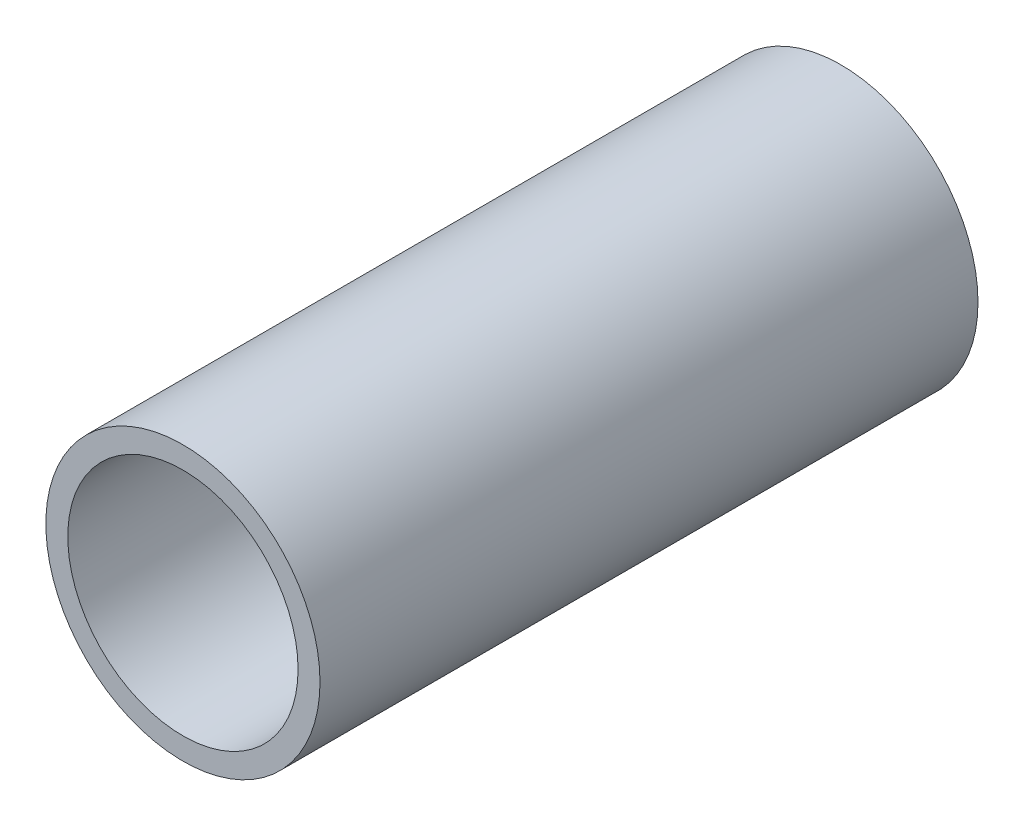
ISO-10303-21;
HEADER;
FILE_DESCRIPTION(('STEP AP214'),'2;1');
FILE_NAME('part.step','',(''),(''),'','','');
FILE_SCHEMA(('AUTOMOTIVE_DESIGN { 1 0 10303 214 1 1 1 1 }'));
ENDSEC;
DATA;
#1=APPLICATION_CONTEXT('core data for automotive mechanical design processes');
#2=APPLICATION_PROTOCOL_DEFINITION('international standard','automotive_design',2000,#1);
#3=PRODUCT_CONTEXT('',#1,'mechanical');
#4=PRODUCT('Part','Part','',(#3));
#5=PRODUCT_RELATED_PRODUCT_CATEGORY('part','',(#4));
#6=PRODUCT_DEFINITION_FORMATION('','',#4);
#7=PRODUCT_DEFINITION_CONTEXT('part definition',#1,'design');
#8=PRODUCT_DEFINITION('design','',#6,#7);
#9=PRODUCT_DEFINITION_SHAPE('','',#8);
#10=(LENGTH_UNIT() NAMED_UNIT(*) SI_UNIT(.MILLI.,.METRE.));
#11=(NAMED_UNIT(*) PLANE_ANGLE_UNIT() SI_UNIT($,.RADIAN.));
#12=(NAMED_UNIT(*) SI_UNIT($,.STERADIAN.) SOLID_ANGLE_UNIT());
#13=UNCERTAINTY_MEASURE_WITH_UNIT(LENGTH_MEASURE(1.E-05),#10,'distance_accuracy_value','');
#14=(GEOMETRIC_REPRESENTATION_CONTEXT(3) GLOBAL_UNCERTAINTY_ASSIGNED_CONTEXT((#13)) GLOBAL_UNIT_ASSIGNED_CONTEXT((#10,
#11,#12)) REPRESENTATION_CONTEXT('',''));
#15=CARTESIAN_POINT('',(0.,0.,0.));
#16=DIRECTION('',(0.,0.,1.));
#17=DIRECTION('',(1.,0.,0.));
#18=AXIS2_PLACEMENT_3D('',#15,#16,#17);
#19=CARTESIAN_POINT('',(0.,0.,60.));
#20=DIRECTION('',(0.,0.,1.));
#21=DIRECTION('',(1.,0.,0.));
#22=AXIS2_PLACEMENT_3D('',#19,#20,#21);
#23=PLANE('',#22);
#24=CARTESIAN_POINT('',(0.,0.,60.));
#25=DIRECTION('',(0.,0.,1.));
#26=DIRECTION('',(1.,0.,0.));
#27=AXIS2_PLACEMENT_3D('',#24,#25,#26);
#28=CIRCLE('',#27,12.5);
#29=CARTESIAN_POINT('',(12.5,0.,60.));
#30=VERTEX_POINT('',#29);
#31=EDGE_CURVE('E10',#30,#30,#28,.T.);
#32=ORIENTED_EDGE('',*,*,#31,.T.);
#33=EDGE_LOOP('',(#32));
#34=FACE_BOUND('',#33,.T.);
#35=CARTESIAN_POINT('',(0.,0.,60.));
#36=DIRECTION('',(0.,0.,1.));
#37=DIRECTION('',(1.,0.,0.));
#38=AXIS2_PLACEMENT_3D('',#35,#36,#37);
#39=CIRCLE('',#38,10.5);
#40=CARTESIAN_POINT('',(10.5,0.,60.));
#41=VERTEX_POINT('',#40);
#42=EDGE_CURVE('E40',#41,#41,#39,.T.);
#43=ORIENTED_EDGE('',*,*,#42,.F.);
#44=EDGE_LOOP('',(#43));
#45=FACE_BOUND('',#44,.T.);
#46=ADVANCED_FACE('F29',(#34,#45),#23,.T.);
#47=CARTESIAN_POINT('',(0.,0.,0.));
#48=DIRECTION('',(0.,0.,1.));
#49=DIRECTION('',(1.,0.,0.));
#50=AXIS2_PLACEMENT_3D('',#47,#48,#49);
#51=PLANE('',#50);
#52=CARTESIAN_POINT('',(0.,0.,0.));
#53=DIRECTION('',(0.,0.,1.));
#54=DIRECTION('',(1.,0.,0.));
#55=AXIS2_PLACEMENT_3D('',#52,#53,#54);
#56=CIRCLE('',#55,12.5);
#57=CARTESIAN_POINT('',(12.5,0.,0.));
#58=VERTEX_POINT('',#57);
#59=EDGE_CURVE('E33',#58,#58,#56,.T.);
#60=ORIENTED_EDGE('',*,*,#59,.F.);
#61=EDGE_LOOP('',(#60));
#62=FACE_BOUND('',#61,.T.);
#63=CARTESIAN_POINT('',(0.,0.,0.));
#64=DIRECTION('',(0.,0.,1.));
#65=DIRECTION('',(1.,0.,0.));
#66=AXIS2_PLACEMENT_3D('',#63,#64,#65);
#67=CIRCLE('',#66,10.5);
#68=CARTESIAN_POINT('',(10.5,0.,0.));
#69=VERTEX_POINT('',#68);
#70=EDGE_CURVE('E42',#69,#69,#67,.T.);
#71=ORIENTED_EDGE('',*,*,#70,.T.);
#72=EDGE_LOOP('',(#71));
#73=FACE_BOUND('',#72,.T.);
#74=ADVANCED_FACE('F52',(#62,#73),#51,.F.);
#75=CARTESIAN_POINT('',(0.,0.,60.));
#76=DIRECTION('',(0.,0.,-1.));
#77=DIRECTION('',(-1.,0.,0.));
#78=AXIS2_PLACEMENT_3D('',#75,#76,#77);
#79=CYLINDRICAL_SURFACE('',#78,12.5);
#80=ORIENTED_EDGE('',*,*,#31,.F.);
#81=EDGE_LOOP('',(#80));
#82=FACE_BOUND('',#81,.T.);
#83=ORIENTED_EDGE('',*,*,#59,.T.);
#84=EDGE_LOOP('',(#83));
#85=FACE_BOUND('',#84,.T.);
#86=ADVANCED_FACE('F31',(#82,#85),#79,.T.);
#87=CARTESIAN_POINT('',(0.,0.,60.));
#88=DIRECTION('',(0.,0.,-1.));
#89=DIRECTION('',(-1.,0.,0.));
#90=AXIS2_PLACEMENT_3D('',#87,#88,#89);
#91=CYLINDRICAL_SURFACE('',#90,10.5);
#92=ORIENTED_EDGE('',*,*,#42,.T.);
#93=EDGE_LOOP('',(#92));
#94=FACE_BOUND('',#93,.T.);
#95=ORIENTED_EDGE('',*,*,#70,.F.);
#96=EDGE_LOOP('',(#95));
#97=FACE_BOUND('',#96,.T.);
#98=ADVANCED_FACE('F48',(#94,#97),#91,.F.);
#99=CLOSED_SHELL('',(#46,#74,#86,#98));
#100=MANIFOLD_SOLID_BREP('B2',#99);
#101=ADVANCED_BREP_SHAPE_REPRESENTATION('',(#18,#100),#14);
#102=SHAPE_DEFINITION_REPRESENTATION(#9,#101);
ENDSEC;
END-ISO-10303-21;
